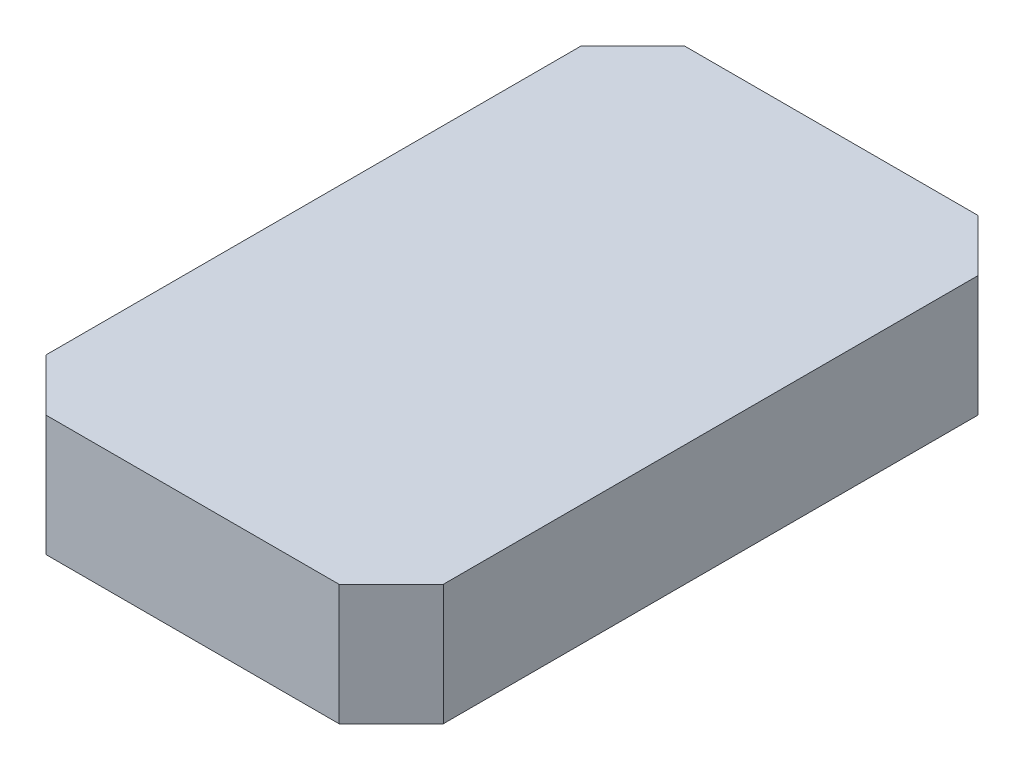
ISO-10303-21;
HEADER;
FILE_DESCRIPTION(('STEP AP214'),'2;1');
FILE_NAME('part.step','',(''),(''),'','','');
FILE_SCHEMA(('AUTOMOTIVE_DESIGN { 1 0 10303 214 1 1 1 1 }'));
ENDSEC;
DATA;
#1=APPLICATION_CONTEXT('core data for automotive mechanical design processes');
#2=APPLICATION_PROTOCOL_DEFINITION('international standard','automotive_design',2000,#1);
#3=PRODUCT_CONTEXT('',#1,'mechanical');
#4=PRODUCT('Part','Part','',(#3));
#5=PRODUCT_RELATED_PRODUCT_CATEGORY('part','',(#4));
#6=PRODUCT_DEFINITION_FORMATION('','',#4);
#7=PRODUCT_DEFINITION_CONTEXT('part definition',#1,'design');
#8=PRODUCT_DEFINITION('design','',#6,#7);
#9=PRODUCT_DEFINITION_SHAPE('','',#8);
#10=(LENGTH_UNIT() NAMED_UNIT(*) SI_UNIT(.MILLI.,.METRE.));
#11=(NAMED_UNIT(*) PLANE_ANGLE_UNIT() SI_UNIT($,.RADIAN.));
#12=(NAMED_UNIT(*) SI_UNIT($,.STERADIAN.) SOLID_ANGLE_UNIT());
#13=UNCERTAINTY_MEASURE_WITH_UNIT(LENGTH_MEASURE(1.E-05),#10,'distance_accuracy_value','');
#14=(GEOMETRIC_REPRESENTATION_CONTEXT(3) GLOBAL_UNCERTAINTY_ASSIGNED_CONTEXT((#13)) GLOBAL_UNIT_ASSIGNED_CONTEXT((#10,
#11,#12)) REPRESENTATION_CONTEXT('',''));
#15=CARTESIAN_POINT('',(0.,0.,0.));
#16=DIRECTION('',(0.,0.,1.));
#17=DIRECTION('',(1.,0.,0.));
#18=AXIS2_PLACEMENT_3D('',#15,#16,#17);
#19=CARTESIAN_POINT('',(5.45857864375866,4.5,-15.9000000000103));
#20=DIRECTION('',(-0.707106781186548,0.,0.707106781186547));
#21=DIRECTION('',(0.707106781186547,0.,0.707106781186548));
#22=AXIS2_PLACEMENT_3D('',#19,#20,#21);
#23=PLANE('',#22);
#24=DIRECTION('',(-0.707106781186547,0.,-0.707106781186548));
#25=VECTOR('',#24,1.);
#26=CARTESIAN_POINT('',(5.45857864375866,0.,-15.9000000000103));
#27=LINE('',#26,#25);
#28=CARTESIAN_POINT('',(7.39999999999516,0.,-13.9585786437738));
#29=VERTEX_POINT('',#28);
#30=CARTESIAN_POINT('',(5.45857864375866,0.,-15.9000000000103));
#31=VERTEX_POINT('',#30);
#32=EDGE_CURVE('E129',#29,#31,#27,.T.);
#33=ORIENTED_EDGE('',*,*,#32,.T.);
#34=DIRECTION('',(0.,-1.,0.));
#35=VECTOR('',#34,1.);
#36=CARTESIAN_POINT('',(5.45857864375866,4.5,-15.9000000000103));
#37=LINE('',#36,#35);
#38=CARTESIAN_POINT('',(5.45857864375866,4.5,-15.9000000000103));
#39=VERTEX_POINT('',#38);
#40=EDGE_CURVE('E11',#39,#31,#37,.T.);
#41=ORIENTED_EDGE('',*,*,#40,.F.);
#42=DIRECTION('',(-0.707106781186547,0.,-0.707106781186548));
#43=VECTOR('',#42,1.);
#44=CARTESIAN_POINT('',(5.45857864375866,4.5,-15.9000000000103));
#45=LINE('',#44,#43);
#46=CARTESIAN_POINT('',(7.39999999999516,4.5,-13.9585786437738));
#47=VERTEX_POINT('',#46);
#48=EDGE_CURVE('E143',#47,#39,#45,.T.);
#49=ORIENTED_EDGE('',*,*,#48,.F.);
#50=DIRECTION('',(0.,-1.,0.));
#51=VECTOR('',#50,1.);
#52=CARTESIAN_POINT('',(7.39999999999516,4.5,-13.9585786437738));
#53=LINE('',#52,#51);
#54=EDGE_CURVE('E125',#47,#29,#53,.T.);
#55=ORIENTED_EDGE('',*,*,#54,.T.);
#56=EDGE_LOOP('',(#33,#41,#49,#55));
#57=FACE_BOUND('',#56,.T.);
#58=ADVANCED_FACE('F33',(#57),#23,.F.);
#59=CARTESIAN_POINT('',(5.45857864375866,4.5,-15.9000000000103));
#60=DIRECTION('',(0.,0.,1.));
#61=DIRECTION('',(1.,0.,0.));
#62=AXIS2_PLACEMENT_3D('',#59,#60,#61);
#63=PLANE('',#62);
#64=DIRECTION('',(-1.,0.,0.));
#65=VECTOR('',#64,1.);
#66=CARTESIAN_POINT('',(5.45857864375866,0.,-15.9000000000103));
#67=LINE('',#66,#65);
#68=CARTESIAN_POINT('',(-5.4585786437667,0.,-15.9000000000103));
#69=VERTEX_POINT('',#68);
#70=EDGE_CURVE('E132',#31,#69,#67,.T.);
#71=ORIENTED_EDGE('',*,*,#70,.T.);
#72=DIRECTION('',(0.,-1.,0.));
#73=VECTOR('',#72,1.);
#74=CARTESIAN_POINT('',(-5.4585786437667,4.5,-15.9000000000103));
#75=LINE('',#74,#73);
#76=CARTESIAN_POINT('',(-5.4585786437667,4.5,-15.9000000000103));
#77=VERTEX_POINT('',#76);
#78=EDGE_CURVE('E41',#77,#69,#75,.T.);
#79=ORIENTED_EDGE('',*,*,#78,.F.);
#80=DIRECTION('',(-1.,0.,0.));
#81=VECTOR('',#80,1.);
#82=CARTESIAN_POINT('',(5.45857864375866,4.5,-15.9000000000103));
#83=LINE('',#82,#81);
#84=EDGE_CURVE('E92',#39,#77,#83,.T.);
#85=ORIENTED_EDGE('',*,*,#84,.F.);
#86=ORIENTED_EDGE('',*,*,#40,.T.);
#87=EDGE_LOOP('',(#71,#79,#85,#86));
#88=FACE_BOUND('',#87,.T.);
#89=ADVANCED_FACE('F178',(#88),#63,.F.);
#90=CARTESIAN_POINT('',(-5.4585786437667,4.5,-15.9000000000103));
#91=DIRECTION('',(0.707106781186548,0.,0.707106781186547));
#92=DIRECTION('',(0.707106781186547,0.,-0.707106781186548));
#93=AXIS2_PLACEMENT_3D('',#90,#91,#92);
#94=PLANE('',#93);
#95=DIRECTION('',(-0.707106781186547,0.,0.707106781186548));
#96=VECTOR('',#95,1.);
#97=CARTESIAN_POINT('',(-5.4585786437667,0.,-15.9000000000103));
#98=LINE('',#97,#96);
#99=CARTESIAN_POINT('',(-7.39999999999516,0.,-13.9585786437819));
#100=VERTEX_POINT('',#99);
#101=EDGE_CURVE('E134',#69,#100,#98,.T.);
#102=ORIENTED_EDGE('',*,*,#101,.T.);
#103=DIRECTION('',(0.,-1.,0.));
#104=VECTOR('',#103,1.);
#105=CARTESIAN_POINT('',(-7.39999999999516,4.5,-13.9585786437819));
#106=LINE('',#105,#104);
#107=CARTESIAN_POINT('',(-7.39999999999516,4.5,-13.9585786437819));
#108=VERTEX_POINT('',#107);
#109=EDGE_CURVE('E150',#108,#100,#106,.T.);
#110=ORIENTED_EDGE('',*,*,#109,.F.);
#111=DIRECTION('',(-0.707106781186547,0.,0.707106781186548));
#112=VECTOR('',#111,1.);
#113=CARTESIAN_POINT('',(-5.4585786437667,4.5,-15.9000000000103));
#114=LINE('',#113,#112);
#115=EDGE_CURVE('E158',#77,#108,#114,.T.);
#116=ORIENTED_EDGE('',*,*,#115,.F.);
#117=ORIENTED_EDGE('',*,*,#78,.T.);
#118=EDGE_LOOP('',(#102,#110,#116,#117));
#119=FACE_BOUND('',#118,.T.);
#120=ADVANCED_FACE('F156',(#119),#94,.F.);
#121=CARTESIAN_POINT('',(-7.39999999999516,4.5,-13.9585786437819));
#122=DIRECTION('',(1.,0.,0.));
#123=DIRECTION('',(0.,0.,-1.));
#124=AXIS2_PLACEMENT_3D('',#121,#122,#123);
#125=PLANE('',#124);
#126=DIRECTION('',(0.,0.,1.));
#127=VECTOR('',#126,1.);
#128=CARTESIAN_POINT('',(-7.39999999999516,0.,-13.9585786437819));
#129=LINE('',#128,#127);
#130=CARTESIAN_POINT('',(-7.39999999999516,0.,5.95857864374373));
#131=VERTEX_POINT('',#130);
#132=EDGE_CURVE('E136',#100,#131,#129,.T.);
#133=ORIENTED_EDGE('',*,*,#132,.T.);
#134=DIRECTION('',(0.,-1.,0.));
#135=VECTOR('',#134,1.);
#136=CARTESIAN_POINT('',(-7.39999999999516,4.5,5.95857864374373));
#137=LINE('',#136,#135);
#138=CARTESIAN_POINT('',(-7.39999999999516,4.5,5.95857864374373));
#139=VERTEX_POINT('',#138);
#140=EDGE_CURVE('E147',#139,#131,#137,.T.);
#141=ORIENTED_EDGE('',*,*,#140,.F.);
#142=DIRECTION('',(0.,0.,1.));
#143=VECTOR('',#142,1.);
#144=CARTESIAN_POINT('',(-7.39999999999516,4.5,-13.9585786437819));
#145=LINE('',#144,#143);
#146=EDGE_CURVE('E170',#108,#139,#145,.T.);
#147=ORIENTED_EDGE('',*,*,#146,.F.);
#148=ORIENTED_EDGE('',*,*,#109,.T.);
#149=EDGE_LOOP('',(#133,#141,#147,#148));
#150=FACE_BOUND('',#149,.T.);
#151=ADVANCED_FACE('F166',(#150),#125,.F.);
#152=CARTESIAN_POINT('',(-5.45857864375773,4.5,7.89999999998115));
#153=DIRECTION('',(0.707106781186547,0.,-0.707106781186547));
#154=DIRECTION('',(-0.707106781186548,0.,-0.707106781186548));
#155=AXIS2_PLACEMENT_3D('',#152,#153,#154);
#156=PLANE('',#155);
#157=DIRECTION('',(0.707106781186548,0.,0.707106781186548));
#158=VECTOR('',#157,1.);
#159=CARTESIAN_POINT('',(-5.45857864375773,0.,7.89999999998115));
#160=LINE('',#159,#158);
#161=CARTESIAN_POINT('',(-5.45857864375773,0.,7.89999999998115));
#162=VERTEX_POINT('',#161);
#163=EDGE_CURVE('E138',#131,#162,#160,.T.);
#164=ORIENTED_EDGE('',*,*,#163,.T.);
#165=DIRECTION('',(0.,-1.,0.));
#166=VECTOR('',#165,1.);
#167=CARTESIAN_POINT('',(-5.45857864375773,4.5,7.89999999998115));
#168=LINE('',#167,#166);
#169=CARTESIAN_POINT('',(-5.45857864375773,4.5,7.89999999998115));
#170=VERTEX_POINT('',#169);
#171=EDGE_CURVE('E120',#170,#162,#168,.T.);
#172=ORIENTED_EDGE('',*,*,#171,.F.);
#173=DIRECTION('',(0.707106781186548,0.,0.707106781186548));
#174=VECTOR('',#173,1.);
#175=CARTESIAN_POINT('',(-5.45857864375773,4.5,7.89999999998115));
#176=LINE('',#175,#174);
#177=EDGE_CURVE('E111',#139,#170,#176,.T.);
#178=ORIENTED_EDGE('',*,*,#177,.F.);
#179=ORIENTED_EDGE('',*,*,#140,.T.);
#180=EDGE_LOOP('',(#164,#172,#178,#179));
#181=FACE_BOUND('',#180,.T.);
#182=ADVANCED_FACE('F169',(#181),#156,.F.);
#183=CARTESIAN_POINT('',(5.45857864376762,4.5,7.89999999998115));
#184=DIRECTION('',(0.,0.,-1.));
#185=DIRECTION('',(-1.,0.,0.));
#186=AXIS2_PLACEMENT_3D('',#183,#184,#185);
#187=PLANE('',#186);
#188=DIRECTION('',(1.,0.,0.));
#189=VECTOR('',#188,1.);
#190=CARTESIAN_POINT('',(5.45857864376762,0.,7.89999999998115));
#191=LINE('',#190,#189);
#192=CARTESIAN_POINT('',(5.45857864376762,0.,7.89999999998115));
#193=VERTEX_POINT('',#192);
#194=EDGE_CURVE('E119',#162,#193,#191,.T.);
#195=ORIENTED_EDGE('',*,*,#194,.T.);
#196=DIRECTION('',(0.,-1.,0.));
#197=VECTOR('',#196,1.);
#198=CARTESIAN_POINT('',(5.45857864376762,4.5,7.89999999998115));
#199=LINE('',#198,#197);
#200=CARTESIAN_POINT('',(5.45857864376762,4.5,7.89999999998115));
#201=VERTEX_POINT('',#200);
#202=EDGE_CURVE('E116',#201,#193,#199,.T.);
#203=ORIENTED_EDGE('',*,*,#202,.F.);
#204=DIRECTION('',(1.,0.,0.));
#205=VECTOR('',#204,1.);
#206=CARTESIAN_POINT('',(5.45857864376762,4.5,7.89999999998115));
#207=LINE('',#206,#205);
#208=EDGE_CURVE('E105',#170,#201,#207,.T.);
#209=ORIENTED_EDGE('',*,*,#208,.F.);
#210=ORIENTED_EDGE('',*,*,#171,.T.);
#211=EDGE_LOOP('',(#195,#203,#209,#210));
#212=FACE_BOUND('',#211,.T.);
#213=ADVANCED_FACE('F117',(#212),#187,.F.);
#214=CARTESIAN_POINT('',(7.39999999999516,4.5,5.95857864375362));
#215=DIRECTION('',(-0.707106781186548,0.,-0.707106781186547));
#216=DIRECTION('',(-0.707106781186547,0.,0.707106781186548));
#217=AXIS2_PLACEMENT_3D('',#214,#215,#216);
#218=PLANE('',#217);
#219=DIRECTION('',(0.707106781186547,0.,-0.707106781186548));
#220=VECTOR('',#219,1.);
#221=CARTESIAN_POINT('',(7.39999999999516,0.,5.95857864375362));
#222=LINE('',#221,#220);
#223=CARTESIAN_POINT('',(7.39999999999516,0.,5.95857864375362));
#224=VERTEX_POINT('',#223);
#225=EDGE_CURVE('E78',#193,#224,#222,.T.);
#226=ORIENTED_EDGE('',*,*,#225,.T.);
#227=DIRECTION('',(0.,-1.,0.));
#228=VECTOR('',#227,1.);
#229=CARTESIAN_POINT('',(7.39999999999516,4.5,5.95857864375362));
#230=LINE('',#229,#228);
#231=CARTESIAN_POINT('',(7.39999999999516,4.5,5.95857864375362));
#232=VERTEX_POINT('',#231);
#233=EDGE_CURVE('E121',#232,#224,#230,.T.);
#234=ORIENTED_EDGE('',*,*,#233,.F.);
#235=DIRECTION('',(0.707106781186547,0.,-0.707106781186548));
#236=VECTOR('',#235,1.);
#237=CARTESIAN_POINT('',(7.39999999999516,4.5,5.95857864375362));
#238=LINE('',#237,#236);
#239=EDGE_CURVE('E109',#201,#232,#238,.T.);
#240=ORIENTED_EDGE('',*,*,#239,.F.);
#241=ORIENTED_EDGE('',*,*,#202,.T.);
#242=EDGE_LOOP('',(#226,#234,#240,#241));
#243=FACE_BOUND('',#242,.T.);
#244=ADVANCED_FACE('F123',(#243),#218,.F.);
#245=CARTESIAN_POINT('',(7.39999999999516,4.5,-13.9585786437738));
#246=DIRECTION('',(-1.,0.,0.));
#247=DIRECTION('',(0.,0.,1.));
#248=AXIS2_PLACEMENT_3D('',#245,#246,#247);
#249=PLANE('',#248);
#250=DIRECTION('',(0.,0.,-1.));
#251=VECTOR('',#250,1.);
#252=CARTESIAN_POINT('',(7.39999999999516,0.,-13.9585786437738));
#253=LINE('',#252,#251);
#254=EDGE_CURVE('E84',#224,#29,#253,.T.);
#255=ORIENTED_EDGE('',*,*,#254,.T.);
#256=ORIENTED_EDGE('',*,*,#54,.F.);
#257=DIRECTION('',(0.,0.,-1.));
#258=VECTOR('',#257,1.);
#259=CARTESIAN_POINT('',(7.39999999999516,4.5,-13.9585786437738));
#260=LINE('',#259,#258);
#261=EDGE_CURVE('E49',#232,#47,#260,.T.);
#262=ORIENTED_EDGE('',*,*,#261,.F.);
#263=ORIENTED_EDGE('',*,*,#233,.T.);
#264=EDGE_LOOP('',(#255,#256,#262,#263));
#265=FACE_BOUND('',#264,.T.);
#266=ADVANCED_FACE('F194',(#265),#249,.F.);
#267=CARTESIAN_POINT('',(0.,4.5,0.));
#268=DIRECTION('',(0.,-1.,0.));
#269=DIRECTION('',(0.,0.,-1.));
#270=AXIS2_PLACEMENT_3D('',#267,#268,#269);
#271=PLANE('',#270);
#272=ORIENTED_EDGE('',*,*,#48,.T.);
#273=ORIENTED_EDGE('',*,*,#84,.T.);
#274=ORIENTED_EDGE('',*,*,#115,.T.);
#275=ORIENTED_EDGE('',*,*,#146,.T.);
#276=ORIENTED_EDGE('',*,*,#177,.T.);
#277=ORIENTED_EDGE('',*,*,#208,.T.);
#278=ORIENTED_EDGE('',*,*,#239,.T.);
#279=ORIENTED_EDGE('',*,*,#261,.T.);
#280=EDGE_LOOP('',(#272,#273,#274,#275,#276,#277,#278,#279));
#281=FACE_BOUND('',#280,.T.);
#282=ADVANCED_FACE('F107',(#281),#271,.F.);
#283=CARTESIAN_POINT('',(0.,0.,0.));
#284=DIRECTION('',(0.,-1.,0.));
#285=DIRECTION('',(0.,0.,-1.));
#286=AXIS2_PLACEMENT_3D('',#283,#284,#285);
#287=PLANE('',#286);
#288=ORIENTED_EDGE('',*,*,#32,.F.);
#289=ORIENTED_EDGE('',*,*,#254,.F.);
#290=ORIENTED_EDGE('',*,*,#225,.F.);
#291=ORIENTED_EDGE('',*,*,#194,.F.);
#292=ORIENTED_EDGE('',*,*,#163,.F.);
#293=ORIENTED_EDGE('',*,*,#132,.F.);
#294=ORIENTED_EDGE('',*,*,#101,.F.);
#295=ORIENTED_EDGE('',*,*,#70,.F.);
#296=EDGE_LOOP('',(#288,#289,#290,#291,#292,#293,#294,#295));
#297=FACE_BOUND('',#296,.T.);
#298=ADVANCED_FACE('F162',(#297),#287,.T.);
#299=CLOSED_SHELL('',(#58,#89,#120,#151,#182,#213,#244,#266,#282,#298));
#300=MANIFOLD_SOLID_BREP('B2',#299);
#301=ADVANCED_BREP_SHAPE_REPRESENTATION('',(#18,#300),#14);
#302=SHAPE_DEFINITION_REPRESENTATION(#9,#301);
ENDSEC;
END-ISO-10303-21;
